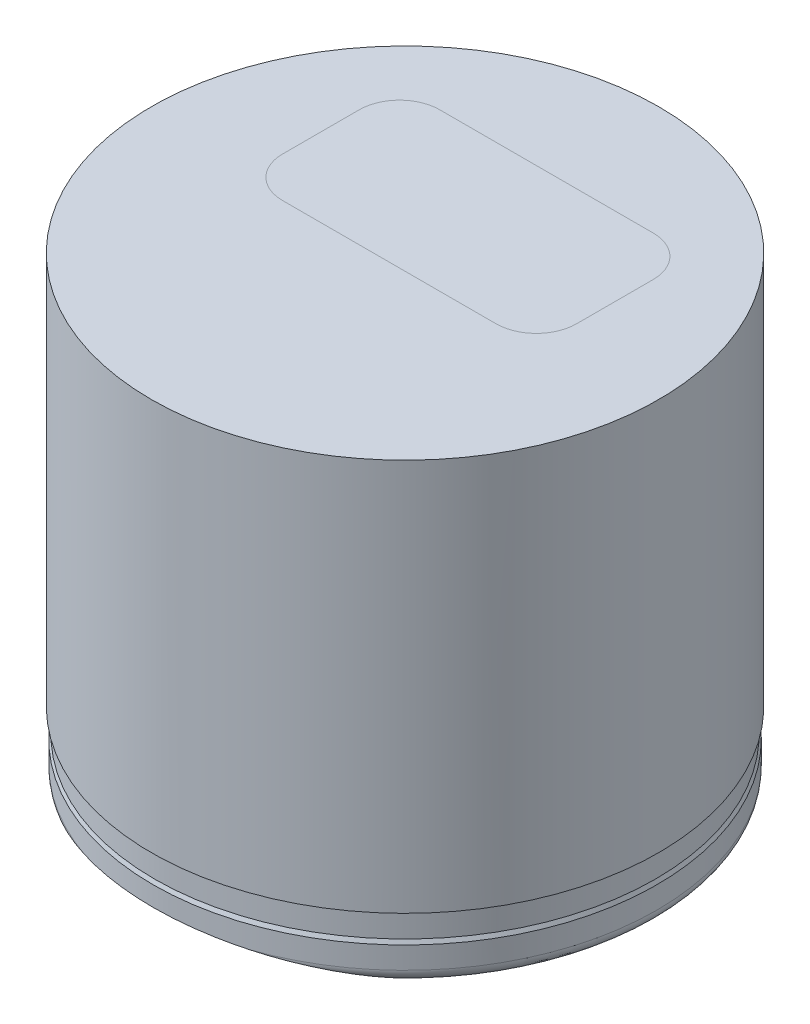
ISO-10303-21;
HEADER;
FILE_DESCRIPTION(('STEP AP214'),'2;1');
FILE_NAME('part.step','',(''),(''),'','','');
FILE_SCHEMA(('AUTOMOTIVE_DESIGN { 1 0 10303 214 1 1 1 1 }'));
ENDSEC;
DATA;
#1=APPLICATION_CONTEXT('core data for automotive mechanical design processes');
#2=APPLICATION_PROTOCOL_DEFINITION('international standard','automotive_design',2000,#1);
#3=PRODUCT_CONTEXT('',#1,'mechanical');
#4=PRODUCT('Part','Part','',(#3));
#5=PRODUCT_RELATED_PRODUCT_CATEGORY('part','',(#4));
#6=PRODUCT_DEFINITION_FORMATION('','',#4);
#7=PRODUCT_DEFINITION_CONTEXT('part definition',#1,'design');
#8=PRODUCT_DEFINITION('design','',#6,#7);
#9=PRODUCT_DEFINITION_SHAPE('','',#8);
#10=(LENGTH_UNIT() NAMED_UNIT(*) SI_UNIT(.MILLI.,.METRE.));
#11=(NAMED_UNIT(*) PLANE_ANGLE_UNIT() SI_UNIT($,.RADIAN.));
#12=(NAMED_UNIT(*) SI_UNIT($,.STERADIAN.) SOLID_ANGLE_UNIT());
#13=UNCERTAINTY_MEASURE_WITH_UNIT(LENGTH_MEASURE(1.E-05),#10,'distance_accuracy_value','');
#14=(GEOMETRIC_REPRESENTATION_CONTEXT(3) GLOBAL_UNCERTAINTY_ASSIGNED_CONTEXT((#13)) GLOBAL_UNIT_ASSIGNED_CONTEXT((#10,
#11,#12)) REPRESENTATION_CONTEXT('',''));
#15=CARTESIAN_POINT('',(0.,0.,0.));
#16=DIRECTION('',(0.,0.,1.));
#17=DIRECTION('',(1.,0.,0.));
#18=AXIS2_PLACEMENT_3D('',#15,#16,#17);
#19=CARTESIAN_POINT('',(0.,0.,0.));
#20=DIRECTION('',(0.,1.,0.));
#21=DIRECTION('',(0.,0.,1.));
#22=AXIS2_PLACEMENT_3D('',#19,#20,#21);
#23=PLANE('',#22);
#24=CARTESIAN_POINT('',(18.8489869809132,0.,5.51909035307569));
#25=DIRECTION('',(0.,1.,0.));
#26=DIRECTION('',(0.,0.,1.));
#27=AXIS2_PLACEMENT_3D('',#24,#25,#26);
#28=ELLIPSE('',#27,5.17913656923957,4.15141606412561);
#29=CARTESIAN_POINT('',(18.8489869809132,0.,10.6982269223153));
#30=VERTEX_POINT('',#29);
#31=EDGE_CURVE('E285',#30,#30,#28,.T.);
#32=ORIENTED_EDGE('',*,*,#31,.T.);
#33=EDGE_LOOP('',(#32));
#34=FACE_BOUND('',#33,.T.);
#35=CARTESIAN_POINT('',(-0.0318256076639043,0.,-4.4942267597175));
#36=DIRECTION('',(0.,-1.,0.));
#37=DIRECTION('',(0.,0.,-1.));
#38=AXIS2_PLACEMENT_3D('',#35,#36,#37);
#39=ELLIPSE('',#38,4.60448881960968,3.65956978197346);
#40=CARTESIAN_POINT('',(-0.0318256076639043,0.,-9.09871557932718));
#41=VERTEX_POINT('',#40);
#42=EDGE_CURVE('E266',#41,#41,#39,.T.);
#43=ORIENTED_EDGE('',*,*,#42,.F.);
#44=EDGE_LOOP('',(#43));
#45=FACE_BOUND('',#44,.T.);
#46=CARTESIAN_POINT('',(0.,0.,7.66782357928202));
#47=DIRECTION('',(0.,-1.,0.));
#48=DIRECTION('',(0.00632907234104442,0.,0.999979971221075));
#49=AXIS2_PLACEMENT_3D('',#46,#47,#48);
#50=ELLIPSE('',#49,5.02847904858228,3.62774417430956);
#51=CARTESIAN_POINT('',(0.0318256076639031,0.,12.6962019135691));
#52=VERTEX_POINT('',#51);
#53=EDGE_CURVE('E258',#52,#52,#50,.T.);
#54=ORIENTED_EDGE('',*,*,#53,.F.);
#55=EDGE_LOOP('',(#54));
#56=FACE_BOUND('',#55,.T.);
#57=CARTESIAN_POINT('',(-18.912638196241,0.,-3.30214239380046));
#58=DIRECTION('',(0.,-1.,0.));
#59=DIRECTION('',(0.,0.,-1.));
#60=AXIS2_PLACEMENT_3D('',#57,#58,#59);
#61=ELLIPSE('',#60,2.18486630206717,1.54812185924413);
#62=CARTESIAN_POINT('',(-18.912638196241,0.,-5.48700869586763));
#63=VERTEX_POINT('',#62);
#64=EDGE_CURVE('E239',#63,#63,#61,.T.);
#65=ORIENTED_EDGE('',*,*,#64,.F.);
#66=EDGE_LOOP('',(#65));
#67=FACE_BOUND('',#66,.T.);
#68=CARTESIAN_POINT('',(-18.912638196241,0.,5.51909035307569));
#69=DIRECTION('',(0.,-1.,0.));
#70=DIRECTION('',(0.,0.,1.));
#71=AXIS2_PLACEMENT_3D('',#68,#69,#70);
#72=ELLIPSE('',#71,5.17913656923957,4.15141606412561);
#73=CARTESIAN_POINT('',(-18.912638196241,0.,10.6982269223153));
#74=VERTEX_POINT('',#73);
#75=EDGE_CURVE('E232',#74,#74,#72,.T.);
#76=ORIENTED_EDGE('',*,*,#75,.F.);
#77=EDGE_LOOP('',(#76));
#78=FACE_BOUND('',#77,.T.);
#79=CARTESIAN_POINT('',(0.,0.,0.));
#80=DIRECTION('',(0.,1.,0.));
#81=DIRECTION('',(0.,0.,1.));
#82=AXIS2_PLACEMENT_3D('',#79,#80,#81);
#83=CIRCLE('',#82,29.718);
#84=CARTESIAN_POINT('',(-21.8623592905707,0.,20.1295));
#85=VERTEX_POINT('',#84);
#86=CARTESIAN_POINT('',(-21.8623592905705,0.,-20.1295000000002));
#87=VERTEX_POINT('',#86);
#88=EDGE_CURVE('E120',#85,#87,#83,.F.);
#89=ORIENTED_EDGE('',*,*,#88,.T.);
#90=DIRECTION('',(-1.,0.,0.));
#91=VECTOR('',#90,1.);
#92=CARTESIAN_POINT('',(31.5214000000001,0.,-20.1295));
#93=LINE('',#92,#91);
#94=CARTESIAN_POINT('',(21.862359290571,0.,-20.1295));
#95=VERTEX_POINT('',#94);
#96=EDGE_CURVE('E62',#95,#87,#93,.T.);
#97=ORIENTED_EDGE('',*,*,#96,.F.);
#98=CARTESIAN_POINT('',(21.8623592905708,0.,20.1294999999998));
#99=VERTEX_POINT('',#98);
#100=EDGE_CURVE('E69',#95,#99,#83,.F.);
#101=ORIENTED_EDGE('',*,*,#100,.T.);
#102=DIRECTION('',(-1.,0.,0.));
#103=VECTOR('',#102,1.);
#104=CARTESIAN_POINT('',(31.5214000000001,0.,20.1295));
#105=LINE('',#104,#103);
#106=EDGE_CURVE('E229',#99,#85,#105,.T.);
#107=ORIENTED_EDGE('',*,*,#106,.T.);
#108=EDGE_LOOP('',(#89,#97,#101,#107));
#109=FACE_BOUND('',#108,.T.);
#110=CARTESIAN_POINT('',(18.8489869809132,0.,-3.30214239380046));
#111=DIRECTION('',(0.,1.,0.));
#112=DIRECTION('',(0.,0.,-1.));
#113=AXIS2_PLACEMENT_3D('',#110,#111,#112);
#114=ELLIPSE('',#113,2.18486630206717,1.54812185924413);
#115=CARTESIAN_POINT('',(18.8489869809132,0.,-5.48700869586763));
#116=VERTEX_POINT('',#115);
#117=EDGE_CURVE('E293',#116,#116,#114,.T.);
#118=ORIENTED_EDGE('',*,*,#117,.T.);
#119=EDGE_LOOP('',(#118));
#120=FACE_BOUND('',#119,.T.);
#121=ADVANCED_FACE('F43',(#34,#45,#56,#67,#78,#109,#120),#23,.F.);
#122=CARTESIAN_POINT('',(0.,1.58749999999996,0.));
#123=DIRECTION('',(0.,1.,0.));
#124=DIRECTION('',(0.,0.,1.));
#125=AXIS2_PLACEMENT_3D('',#122,#123,#124);
#126=TOROIDAL_SURFACE('',#125,29.718,1.5875);
#127=CARTESIAN_POINT('',(10.2789407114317,1.58769999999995,-29.5698783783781));
#128=CARTESIAN_POINT('',(10.5281118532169,1.57313295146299,-29.4832634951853));
#129=CARTESIAN_POINT('',(10.7760853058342,1.5580069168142,-29.3933249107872));
#130=CARTESIAN_POINT('',(11.269412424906,1.52663347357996,-29.2067801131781));
#131=CARTESIAN_POINT('',(11.514766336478,1.51038617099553,-29.1101745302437));
#132=CARTESIAN_POINT('',(12.2501077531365,1.4597134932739,-28.8088775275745));
#133=CARTESIAN_POINT('',(12.7358196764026,1.42356459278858,-28.5939381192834));
#134=CARTESIAN_POINT('',(13.8462893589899,1.33443142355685,-28.0639571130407));
#135=CARTESIAN_POINT('',(14.4661219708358,1.27974992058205,-27.7388238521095));
#136=CARTESIAN_POINT('',(15.6779821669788,1.16224752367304,-27.0401609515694));
#137=CARTESIAN_POINT('',(16.2699863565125,1.09941994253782,-26.6665915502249));
#138=CARTESIAN_POINT('',(17.1304249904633,0.999148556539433,-26.0703833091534));
#139=CARTESIAN_POINT('',(17.4120863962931,0.964797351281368,-25.8661328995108));
#140=CARTESIAN_POINT('',(17.965715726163,0.894013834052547,-25.4452579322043));
#141=CARTESIAN_POINT('',(18.237685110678,0.857581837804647,-25.2286352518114));
#142=CARTESIAN_POINT('',(18.7703824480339,0.782625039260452,-24.7829461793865));
#143=CARTESIAN_POINT('',(19.031123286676,0.744102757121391,-24.5538947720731));
#144=CARTESIAN_POINT('',(19.540002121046,0.664845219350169,-24.0826337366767));
#145=CARTESIAN_POINT('',(19.7881445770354,0.624110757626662,-23.8404288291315));
#146=CARTESIAN_POINT('',(20.107215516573,0.56851415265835,-23.5098544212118));
#147=CARTESIAN_POINT('',(20.1849026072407,0.554711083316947,-23.4277821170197));
#148=CARTESIAN_POINT('',(20.3385375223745,0.526842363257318,-23.2620762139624));
#149=CARTESIAN_POINT('',(20.4144854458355,0.512776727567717,-23.1784427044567));
#150=CARTESIAN_POINT('',(20.6395395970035,0.470164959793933,-22.9250754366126));
#151=CARTESIAN_POINT('',(20.7858352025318,0.441207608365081,-22.7528965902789));
#152=CARTESIAN_POINT('',(21.0695175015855,0.382026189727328,-22.4010070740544));
#153=CARTESIAN_POINT('',(21.2068892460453,0.351800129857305,-22.2212845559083));
#154=CARTESIAN_POINT('',(21.4036021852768,0.305377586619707,-21.9452586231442));
#155=CARTESIAN_POINT('',(21.4676086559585,0.289724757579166,-21.852187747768));
#156=CARTESIAN_POINT('',(21.5917498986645,0.258006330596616,-21.6635916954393));
#157=CARTESIAN_POINT('',(21.651885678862,0.241940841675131,-21.568067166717));
#158=CARTESIAN_POINT('',(21.7671868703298,0.209308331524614,-21.3740360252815));
#159=CARTESIAN_POINT('',(21.8223501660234,0.192741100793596,-21.2755281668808));
#160=CARTESIAN_POINT('',(21.8995843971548,0.16741850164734,-21.1249613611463));
#161=CARTESIAN_POINT('',(21.9244200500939,0.158895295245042,-21.0742828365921));
#162=CARTESIAN_POINT('',(21.9716885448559,0.141668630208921,-20.9718540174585));
#163=CARTESIAN_POINT('',(21.9941223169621,0.132965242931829,-20.9201041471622));
#164=CARTESIAN_POINT('',(22.0357714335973,0.115317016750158,-20.8151687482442));
#165=CARTESIAN_POINT('',(22.054976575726,0.106371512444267,-20.7619792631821));
#166=CARTESIAN_POINT('',(22.0884546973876,0.0882418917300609,-20.654181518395));
#167=CARTESIAN_POINT('',(22.1027443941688,0.0790587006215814,-20.5995787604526));
#168=CARTESIAN_POINT('',(22.1166793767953,0.0660402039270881,-20.5221714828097));
#169=CARTESIAN_POINT('',(22.1199615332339,0.0623144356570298,-20.5000182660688));
#170=CARTESIAN_POINT('',(22.1246702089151,0.0548177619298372,-20.4554434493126));
#171=CARTESIAN_POINT('',(22.1260917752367,0.0510467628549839,-20.4330212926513));
#172=CARTESIAN_POINT('',(22.126364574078,0.0434502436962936,-20.3878528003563));
#173=CARTESIAN_POINT('',(22.1251827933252,0.0396246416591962,-20.3651059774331));
#174=CARTESIAN_POINT('',(22.1189905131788,0.0320590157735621,-20.3201211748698));
#175=CARTESIAN_POINT('',(22.1140003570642,0.0283186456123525,-20.2978811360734));
#176=CARTESIAN_POINT('',(22.1022960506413,0.0228590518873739,-20.2654186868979));
#177=CARTESIAN_POINT('',(22.0975370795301,0.0210261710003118,-20.2545204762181));
#178=CARTESIAN_POINT('',(22.0863479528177,0.017506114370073,-20.233590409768));
#179=CARTESIAN_POINT('',(22.0799200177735,0.0158187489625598,-20.2235574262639));
#180=CARTESIAN_POINT('',(22.0652915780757,0.0126465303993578,-20.2046955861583));
#181=CARTESIAN_POINT('',(22.0570774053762,0.0111633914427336,-20.1958769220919));
#182=CARTESIAN_POINT('',(22.0391179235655,0.00847826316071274,-20.1799112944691));
#183=CARTESIAN_POINT('',(22.029372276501,0.00727633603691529,-20.17276470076));
#184=CARTESIAN_POINT('',(22.009651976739,0.00526743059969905,-20.1608198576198));
#185=CARTESIAN_POINT('',(21.9997683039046,0.00443545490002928,-20.1558729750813));
#186=CARTESIAN_POINT('',(21.979396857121,0.00301260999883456,-20.1474128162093));
#187=CARTESIAN_POINT('',(21.9689088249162,0.00242184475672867,-20.143900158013));
#188=CARTESIAN_POINT('',(21.939644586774,0.00109067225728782,-20.1359850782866));
#189=CARTESIAN_POINT('',(21.9205149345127,0.000566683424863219,-20.1328694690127));
#190=CARTESIAN_POINT('',(21.8819983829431,-9.17007251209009E-06,-20.1294454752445));
#191=CARTESIAN_POINT('',(21.8626107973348,-5.92955597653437E-05,-20.1291474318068));
#192=CARTESIAN_POINT('',(21.8175176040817,0.000218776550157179,-20.1308008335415));
#193=CARTESIAN_POINT('',(21.7918469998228,0.000677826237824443,-20.1335303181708));
#194=CARTESIAN_POINT('',(21.7408684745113,0.00199725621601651,-20.1413755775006));
#195=CARTESIAN_POINT('',(21.7155614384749,0.00285848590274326,-20.146496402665));
#196=CARTESIAN_POINT('',(21.6400134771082,0.00586881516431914,-20.1643956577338));
#197=CARTESIAN_POINT('',(21.5903978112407,0.00844024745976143,-20.1796852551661));
#198=CARTESIAN_POINT('',(21.4889477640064,0.0144155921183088,-20.2152143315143));
#199=CARTESIAN_POINT('',(21.4372222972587,0.017867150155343,-20.2357371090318));
#200=CARTESIAN_POINT('',(21.3349409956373,0.025223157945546,-20.2794755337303));
#201=CARTESIAN_POINT('',(21.2843856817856,0.0291278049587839,-20.302692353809));
#202=CARTESIAN_POINT('',(21.1337949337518,0.0413106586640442,-20.3751309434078));
#203=CARTESIAN_POINT('',(21.0351024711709,0.0500399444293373,-20.427034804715));
#204=CARTESIAN_POINT('',(20.8397508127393,0.0681369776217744,-20.5346387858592));
#205=CARTESIAN_POINT('',(20.7430946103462,0.0775055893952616,-20.5903440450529));
#206=CARTESIAN_POINT('',(20.5513199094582,0.0966096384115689,-20.7039356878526));
#207=CARTESIAN_POINT('',(20.4561992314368,0.106344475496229,-20.7618185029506));
#208=CARTESIAN_POINT('',(20.2680077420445,0.125928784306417,-20.8782657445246));
#209=CARTESIAN_POINT('',(20.1749260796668,0.135775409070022,-20.9368132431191));
#210=CARTESIAN_POINT('',(19.989323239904,0.155613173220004,-21.0547675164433));
#211=CARTESIAN_POINT('',(19.8968020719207,0.165604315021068,-21.1141743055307));
#212=CARTESIAN_POINT('',(19.6197182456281,0.195704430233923,-21.2931479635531));
#213=CARTESIAN_POINT('',(19.4356510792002,0.215938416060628,-21.4134581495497));
#214=CARTESIAN_POINT('',(19.0675462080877,0.256461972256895,-21.6544090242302));
#215=CARTESIAN_POINT('',(18.8835086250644,0.276751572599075,-21.7750498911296));
#216=CARTESIAN_POINT('',(18.5149319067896,0.317202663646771,-22.0155698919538));
#217=CARTESIAN_POINT('',(18.3303927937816,0.337364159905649,-22.1354490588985));
#218=CARTESIAN_POINT('',(17.9608869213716,0.377387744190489,-22.3734271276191));
#219=CARTESIAN_POINT('',(17.7759228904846,0.397250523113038,-22.4915301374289));
#220=CARTESIAN_POINT('',(17.4047515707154,0.436654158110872,-22.7258220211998));
#221=CARTESIAN_POINT('',(17.2185442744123,0.456195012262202,-22.8420108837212));
#222=CARTESIAN_POINT('',(16.6577707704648,0.514233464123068,-23.1871043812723));
#223=CARTESIAN_POINT('',(16.2810070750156,0.552151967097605,-23.4125657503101));
#224=CARTESIAN_POINT('',(15.6150284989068,0.616900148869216,-23.7975549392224));
#225=CARTESIAN_POINT('',(15.3272874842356,0.644146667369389,-23.9595612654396));
#226=CARTESIAN_POINT('',(14.7477994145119,0.697441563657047,-24.2764498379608));
#227=CARTESIAN_POINT('',(14.4560523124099,0.723489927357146,-24.431332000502));
#228=CARTESIAN_POINT('',(13.5746546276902,0.799686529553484,-24.8843928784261));
#229=CARTESIAN_POINT('',(12.9788140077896,0.847889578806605,-25.1710056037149));
#230=CARTESIAN_POINT('',(11.7700887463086,0.938531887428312,-25.7099598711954));
#231=CARTESIAN_POINT('',(11.1571756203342,0.980960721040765,-25.9622394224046));
#232=CARTESIAN_POINT('',(9.91656821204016,1.05944421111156,-26.4288980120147));
#233=CARTESIAN_POINT('',(9.28887191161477,1.09549799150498,-26.643271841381));
#234=CARTESIAN_POINT('',(7.86860402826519,1.16862048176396,-27.0780542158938));
#235=CARTESIAN_POINT('',(7.07257265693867,1.20386145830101,-27.2875951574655));
#236=CARTESIAN_POINT('',(5.46546329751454,1.26321694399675,-27.6405196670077));
#237=CARTESIAN_POINT('',(4.65438388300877,1.28733039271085,-27.7838969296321));
#238=CARTESIAN_POINT('',(3.02292885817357,1.32396769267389,-28.0017403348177));
#239=CARTESIAN_POINT('',(2.20255563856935,1.33649445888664,-28.0762238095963));
#240=CARTESIAN_POINT('',(0.558381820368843,1.34972384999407,-28.1548850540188));
#241=CARTESIAN_POINT('',(-0.265418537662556,1.35042729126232,-28.1590676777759));
#242=CARTESIAN_POINT('',(-1.86111177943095,1.34031232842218,-28.0989246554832));
#243=CARTESIAN_POINT('',(-2.63316633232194,1.33017954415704,-28.0386756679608));
#244=CARTESIAN_POINT('',(-4.16982305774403,1.29962732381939,-27.8570138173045));
#245=CARTESIAN_POINT('',(-4.93442528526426,1.27920796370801,-27.7356014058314));
#246=CARTESIAN_POINT('',(-6.45123394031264,1.22843533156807,-27.4337100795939));
#247=CARTESIAN_POINT('',(-7.20344421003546,1.19808520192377,-27.2532498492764));
#248=CARTESIAN_POINT('',(-8.69158884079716,1.12794699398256,-26.8362118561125));
#249=CARTESIAN_POINT('',(-9.42752493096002,1.08815992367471,-26.5996400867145));
#250=CARTESIAN_POINT('',(-10.6774100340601,1.01211581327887,-26.1474859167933));
#251=CARTESIAN_POINT('',(-11.1960736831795,0.977964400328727,-25.9444234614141));
#252=CARTESIAN_POINT('',(-12.2223245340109,0.905386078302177,-25.5128766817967));
#253=CARTESIAN_POINT('',(-12.7299132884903,0.866959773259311,-25.2843959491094));
#254=CARTESIAN_POINT('',(-13.7332004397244,0.786201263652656,-24.8042102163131));
#255=CARTESIAN_POINT('',(-14.2289066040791,0.743871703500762,-24.5525209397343));
#256=CARTESIAN_POINT('',(-15.2088043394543,0.655701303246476,-24.0282645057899));
#257=CARTESIAN_POINT('',(-15.6929958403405,0.609860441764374,-23.7556972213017));
#258=CARTESIAN_POINT('',(-16.4431447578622,0.535746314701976,-23.3150186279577));
#259=CARTESIAN_POINT('',(-16.712721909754,0.508471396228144,-23.1528434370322));
#260=CARTESIAN_POINT('',(-17.2488476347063,0.453120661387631,-22.8237309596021));
#261=CARTESIAN_POINT('',(-17.5153963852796,0.425044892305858,-22.6567939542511));
#262=CARTESIAN_POINT('',(-18.046104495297,0.36827665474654,-22.3192530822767));
#263=CARTESIAN_POINT('',(-18.3102637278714,0.339584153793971,-22.1486490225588));
#264=CARTESIAN_POINT('',(-18.7055269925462,0.29630305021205,-21.8913019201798));
#265=CARTESIAN_POINT('',(-18.8371168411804,0.281835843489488,-21.8052806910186));
#266=CARTESIAN_POINT('',(-19.1001941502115,0.252875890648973,-21.6330863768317));
#267=CARTESIAN_POINT('',(-19.2316816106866,0.238383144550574,-21.5469132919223));
#268=CARTESIAN_POINT('',(-19.4947968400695,0.209450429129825,-21.3748809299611));
#269=CARTESIAN_POINT('',(-19.6264245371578,0.195010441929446,-21.2890215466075));
#270=CARTESIAN_POINT('',(-19.8903232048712,0.166284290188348,-21.1182174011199));
#271=CARTESIAN_POINT('',(-20.0225942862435,0.151998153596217,-21.0332728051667));
#272=CARTESIAN_POINT('',(-20.2884661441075,0.123744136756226,-20.8652759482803));
#273=CARTESIAN_POINT('',(-20.4220674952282,0.109776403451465,-20.7822245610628));
#274=CARTESIAN_POINT('',(-20.6242418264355,0.0893119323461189,-20.660543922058));
#275=CARTESIAN_POINT('',(-20.691918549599,0.0825725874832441,-20.6204721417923));
#276=CARTESIAN_POINT('',(-20.8280955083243,0.0693275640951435,-20.5417179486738));
#277=CARTESIAN_POINT('',(-20.8965956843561,0.0628218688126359,-20.5030354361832));
#278=CARTESIAN_POINT('',(-21.0483861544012,0.0488973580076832,-20.4202410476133));
#279=CARTESIAN_POINT('',(-21.1319244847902,0.0415521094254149,-20.3765665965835));
#280=CARTESIAN_POINT('',(-21.3012705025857,0.0276885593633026,-20.2941346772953));
#281=CARTESIAN_POINT('',(-21.3870719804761,0.0211682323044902,-20.2553651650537));
#282=CARTESIAN_POINT('',(-21.5336121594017,0.0116313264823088,-20.1986592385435));
#283=CARTESIAN_POINT('',(-21.5932287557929,0.0081698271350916,-20.178077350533));
#284=CARTESIAN_POINT('',(-21.6879460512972,0.0038766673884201,-20.152550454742));
#285=CARTESIAN_POINT('',(-21.7222283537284,0.00255898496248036,-20.1447155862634));
#286=CARTESIAN_POINT('',(-21.7915015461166,0.000626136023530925,-20.1332229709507));
#287=CARTESIAN_POINT('',(-21.826488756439,7.97386302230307E-06,-20.1295474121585));
#288=CARTESIAN_POINT('',(-21.8762992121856,-3.19217270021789E-06,-20.1294810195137));
#289=CARTESIAN_POINT('',(-21.8910992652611,0.000102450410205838,-20.1301091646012));
#290=CARTESIAN_POINT('',(-21.9205546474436,0.000600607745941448,-20.1330711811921));
#291=CARTESIAN_POINT('',(-21.9352098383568,0.000993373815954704,-20.1354065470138));
#292=CARTESIAN_POINT('',(-21.9642393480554,0.00215258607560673,-20.1422991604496));
#293=CARTESIAN_POINT('',(-21.9786060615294,0.00292459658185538,-20.1468894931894));
#294=CARTESIAN_POINT('',(-22.0061396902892,0.00492034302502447,-20.1587560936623));
#295=CARTESIAN_POINT('',(-22.019310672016,0.00614247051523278,-20.1660227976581));
#296=CARTESIAN_POINT('',(-22.0421701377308,0.00887509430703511,-20.1822708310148));
#297=CARTESIAN_POINT('',(-22.0520872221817,0.0103326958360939,-20.1909376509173));
#298=CARTESIAN_POINT('',(-22.0699427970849,0.0135509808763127,-20.2100733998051));
#299=CARTESIAN_POINT('',(-22.0778793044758,0.0153119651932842,-20.2205441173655));
#300=CARTESIAN_POINT('',(-22.0921765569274,0.0191780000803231,-20.2435313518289));
#301=CARTESIAN_POINT('',(-22.0983795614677,0.0212987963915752,-20.256141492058));
#302=CARTESIAN_POINT('',(-22.1086584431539,0.0256765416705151,-20.2821713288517));
#303=CARTESIAN_POINT('',(-22.1127305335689,0.0279337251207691,-20.295592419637));
#304=CARTESIAN_POINT('',(-22.1213255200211,0.0340778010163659,-20.3321247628));
#305=CARTESIAN_POINT('',(-22.1242541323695,0.0380240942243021,-20.3555892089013));
#306=CARTESIAN_POINT('',(-22.1267642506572,0.0459431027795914,-20.4026752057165));
#307=CARTESIAN_POINT('',(-22.126335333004,0.0499158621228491,-20.4262970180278));
#308=CARTESIAN_POINT('',(-22.1224053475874,0.0596848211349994,-20.4843827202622));
#309=CARTESIAN_POINT('',(-22.1175611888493,0.0654647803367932,-20.5187500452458));
#310=CARTESIAN_POINT('',(-22.1046778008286,0.0769294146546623,-20.5869181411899));
#311=CARTESIAN_POINT('',(-22.0966313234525,0.0826138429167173,-20.6207174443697));
#312=CARTESIAN_POINT('',(-22.0782456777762,0.0939116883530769,-20.6878938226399));
#313=CARTESIAN_POINT('',(-22.0678941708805,0.099524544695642,-20.7212675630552));
#314=CARTESIAN_POINT('',(-22.0455169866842,0.110649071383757,-20.7874133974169));
#315=CARTESIAN_POINT('',(-22.0334931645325,0.116160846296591,-20.8201861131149));
#316=CARTESIAN_POINT('',(-21.9968581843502,0.131970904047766,-20.9141918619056));
#317=CARTESIAN_POINT('',(-21.9705704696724,0.142162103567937,-20.9747881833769));
#318=CARTESIAN_POINT('',(-21.9147883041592,0.162301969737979,-21.0945387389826));
#319=CARTESIAN_POINT('',(-21.885291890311,0.172250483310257,-21.1536920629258));
#320=CARTESIAN_POINT('',(-21.7930959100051,0.201827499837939,-21.3295554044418));
#321=CARTESIAN_POINT('',(-21.726792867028,0.221146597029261,-21.4444257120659));
#322=CARTESIAN_POINT('',(-21.5878587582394,0.259157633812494,-21.6704372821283));
#323=CARTESIAN_POINT('',(-21.5152221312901,0.277849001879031,-21.7815751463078));
#324=CARTESIAN_POINT('',(-21.3652541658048,0.314670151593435,-22.0005117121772));
#325=CARTESIAN_POINT('',(-21.287928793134,0.332800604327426,-22.108314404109));
#326=CARTESIAN_POINT('',(-21.0759721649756,0.380667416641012,-22.3929278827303));
#327=CARTESIAN_POINT('',(-20.9378752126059,0.40998134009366,-22.5672268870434));
#328=CARTESIAN_POINT('',(-20.6533498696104,0.467482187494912,-22.9091238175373));
#329=CARTESIAN_POINT('',(-20.5069185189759,0.495668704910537,-23.0767193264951));
#330=CARTESIAN_POINT('',(-20.2068976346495,0.551050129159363,-23.4060142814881));
#331=CARTESIAN_POINT('',(-20.0532974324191,0.578243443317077,-23.567704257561));
#332=CARTESIAN_POINT('',(-19.7400602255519,0.631658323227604,-23.8853062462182));
#333=CARTESIAN_POINT('',(-19.5804224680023,0.657879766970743,-24.0412175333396));
#334=CARTESIAN_POINT('',(-19.0926554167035,0.735282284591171,-24.5014487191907));
#335=CARTESIAN_POINT('',(-18.7564147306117,0.785066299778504,-24.7974617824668));
#336=CARTESIAN_POINT('',(-18.06643535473,0.881055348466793,-25.3682074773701));
#337=CARTESIAN_POINT('',(-17.7127098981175,0.927263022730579,-25.6429558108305));
#338=CARTESIAN_POINT('',(-16.8111501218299,1.03827059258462,-26.3030008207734));
#339=CARTESIAN_POINT('',(-16.2538347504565,1.10096356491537,-26.6757698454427));
#340=CARTESIAN_POINT('',(-15.1108303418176,1.21892239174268,-27.3771466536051));
#341=CARTESIAN_POINT('',(-14.5251165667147,1.27418160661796,-27.7057149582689));
#342=CARTESIAN_POINT('',(-13.3390757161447,1.37657493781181,-28.3145401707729));
#343=CARTESIAN_POINT('',(-12.7390757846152,1.42381360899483,-28.5954187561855));
#344=CARTESIAN_POINT('',(-11.5214538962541,1.5111006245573,-29.1144226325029));
#345=CARTESIAN_POINT('',(-10.9038612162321,1.55116018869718,-29.3526146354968));
#346=CARTESIAN_POINT('',(-10.2789407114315,1.58769999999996,-29.5698783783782));
#347=B_SPLINE_CURVE_WITH_KNOTS('',3,(#127,#128,#129,#130,#131,#132,#133,#134,#135,#136,#137,
#138,#139,#140,#141,#142,#143,#144,#145,#146,#147,#148,#149,#150,#151,#152,#153,#154,#155,#156,
#157,#158,#159,#160,#161,#162,#163,#164,#165,#166,#167,#168,#169,#170,#171,#172,#173,#174,#175,
#176,#177,#178,#179,#180,#181,#182,#183,#184,#185,#186,#187,#188,#189,#190,#191,#192,#193,#194,
#195,#196,#197,#198,#199,#200,#201,#202,#203,#204,#205,#206,#207,#208,#209,#210,#211,#212,#213,
#214,#215,#216,#217,#218,#219,#220,#221,#222,#223,#224,#225,#226,#227,#228,#229,#230,#231,#232,
#233,#234,#235,#236,#237,#238,#239,#240,#241,#242,#243,#244,#245,#246,#247,#248,#249,#250,#251,
#252,#253,#254,#255,#256,#257,#258,#259,#260,#261,#262,#263,#264,#265,#266,#267,#268,#269,#270,
#271,#272,#273,#274,#275,#276,#277,#278,#279,#280,#281,#282,#283,#284,#285,#286,#287,#288,#289,
#290,#291,#292,#293,#294,#295,#296,#297,#298,#299,#300,#301,#302,#303,#304,#305,#306,#307,#308,
#309,#310,#311,#312,#313,#314,#315,#316,#317,#318,#319,#320,#321,#322,#323,#324,#325,#326,#327,
#328,#329,#330,#331,#332,#333,#334,#335,#336,#337,#338,#339,#340,#341,#342,#343,#344,#345,#346),
.UNSPECIFIED.,.F.,.F.,(4,2,2,2,2,2,2,2,2,2,2,2,2,2,2,2,2,2,2,2,2,2,2,2,2,2,2,2,2,2,2,2,2,2,2,2,
2,2,2,2,2,2,2,2,2,2,2,2,2,2,2,2,2,2,2,2,2,2,2,2,2,2,2,2,2,2,2,2,2,2,2,2,2,2,2,2,2,2,2,2,2,2,2,2,
2,2,2,2,2,2,2,2,2,2,2,2,2,2,2,2,2,2,2,2,2,2,2,2,2,4),(0.,0.792550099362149,1.58502537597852,
3.18126520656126,5.28534028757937,7.39115369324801,8.43971171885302,9.48811106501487,
10.5352733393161,11.5820622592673,11.9235921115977,12.2651024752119,12.9482142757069,
13.6324423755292,13.9744750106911,14.3164181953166,14.6585061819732,14.8296954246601,
15.0008181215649,15.1724717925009,15.3435357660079,15.411591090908,15.4798272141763,
15.5489336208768,15.6176734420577,15.6536516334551,15.6895821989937,15.72579803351,
15.7620218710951,15.7951455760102,15.8282835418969,15.8861098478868,15.9441483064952,
16.0214165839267,16.0988487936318,16.2544661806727,16.4216417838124,16.5888904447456,
16.9242508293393,17.2600739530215,17.5953688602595,17.9265736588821,18.2577839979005,
18.9202609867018,19.5832261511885,20.2461623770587,20.9072043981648,21.5682503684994,
22.8901775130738,23.8840871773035,24.8780085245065,26.8657340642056,28.8570022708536,
30.8485439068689,33.3173971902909,35.7864857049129,38.2549528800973,40.7232496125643,
43.0441301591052,45.3649935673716,47.685123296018,50.0050053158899,51.678455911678,
53.3516703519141,55.0237594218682,56.6958586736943,57.6431494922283,58.5903844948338,
59.5376694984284,60.0112977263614,60.4849255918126,60.9583744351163,61.4319078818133,
61.9056556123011,62.1424596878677,62.3792467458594,62.6628200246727,62.9456828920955,
63.1347634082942,63.2402201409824,63.3452235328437,63.389590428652,63.4339962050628,
63.479073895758,63.5239920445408,63.563466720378,63.6029807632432,63.645385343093,
63.6878650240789,63.7593799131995,63.8311169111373,63.9364071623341,64.0419370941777,
64.1480461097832,64.2540383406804,64.4543889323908,64.654862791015,65.0566095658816,
65.4587127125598,65.8603145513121,66.5328645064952,67.205654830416,67.8794804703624,
68.5533904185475,69.9045111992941,71.254624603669,73.2724488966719,75.2920636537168,
77.2829009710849,79.2705992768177),.UNSPECIFIED.);
#348=CARTESIAN_POINT('',(10.2823611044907,1.58749999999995,-29.5686891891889));
#349=VERTEX_POINT('',#348);
#350=EDGE_CURVE('E12',#349,#95,#347,.T.);
#351=ORIENTED_EDGE('',*,*,#350,.F.);
#352=CARTESIAN_POINT('',(0.,1.58749999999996,0.));
#353=DIRECTION('',(0.,1.,0.));
#354=DIRECTION('',(0.,0.,1.));
#355=AXIS2_PLACEMENT_3D('',#352,#353,#354);
#356=CIRCLE('',#355,31.3055);
#357=CARTESIAN_POINT('',(10.2823611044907,1.58749999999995,29.5686891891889));
#358=VERTEX_POINT('',#357);
#359=EDGE_CURVE('E127',#358,#349,#356,.T.);
#360=ORIENTED_EDGE('',*,*,#359,.F.);
#361=CARTESIAN_POINT('',(-10.2789407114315,1.58769999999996,29.5698783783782));
#362=CARTESIAN_POINT('',(-10.5281118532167,1.573132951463,29.4832634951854));
#363=CARTESIAN_POINT('',(-10.7760853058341,1.55800691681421,29.3933249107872));
#364=CARTESIAN_POINT('',(-11.2694124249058,1.52663347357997,29.2067801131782));
#365=CARTESIAN_POINT('',(-11.5147663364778,1.51038617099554,29.1101745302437));
#366=CARTESIAN_POINT('',(-12.2501077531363,1.45971349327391,28.8088775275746));
#367=CARTESIAN_POINT('',(-12.7358196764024,1.42356459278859,28.5939381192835));
#368=CARTESIAN_POINT('',(-13.8462893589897,1.33443142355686,28.0639571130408));
#369=CARTESIAN_POINT('',(-14.4661219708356,1.27974992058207,27.7388238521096));
#370=CARTESIAN_POINT('',(-15.6779821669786,1.16224752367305,27.0401609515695));
#371=CARTESIAN_POINT('',(-16.2699863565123,1.09941994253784,26.666591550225));
#372=CARTESIAN_POINT('',(-17.1304249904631,0.999148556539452,26.0703833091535));
#373=CARTESIAN_POINT('',(-17.4120863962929,0.964797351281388,25.866132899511));
#374=CARTESIAN_POINT('',(-17.9657157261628,0.894013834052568,25.4452579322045));
#375=CARTESIAN_POINT('',(-18.2376851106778,0.857581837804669,25.2286352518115));
#376=CARTESIAN_POINT('',(-18.7703824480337,0.782625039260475,24.7829461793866));
#377=CARTESIAN_POINT('',(-19.0311232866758,0.744102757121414,24.5538947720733));
#378=CARTESIAN_POINT('',(-19.5400021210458,0.664845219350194,24.0826337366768));
#379=CARTESIAN_POINT('',(-19.7881445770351,0.624110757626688,23.8404288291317));
#380=CARTESIAN_POINT('',(-20.1072155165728,0.568514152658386,23.509854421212));
#381=CARTESIAN_POINT('',(-20.1849026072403,0.554711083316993,23.42778211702));
#382=CARTESIAN_POINT('',(-20.3385375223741,0.526842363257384,23.2620762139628));
#383=CARTESIAN_POINT('',(-20.414485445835,0.512776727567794,23.1784427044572));
#384=CARTESIAN_POINT('',(-20.6395395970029,0.470164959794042,22.9250754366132));
#385=CARTESIAN_POINT('',(-20.7858352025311,0.441207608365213,22.7528965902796));
#386=CARTESIAN_POINT('',(-21.0695175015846,0.382026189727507,22.4010070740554));
#387=CARTESIAN_POINT('',(-21.2068892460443,0.351800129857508,22.2212845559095));
#388=CARTESIAN_POINT('',(-21.4036021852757,0.30537758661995,21.9452586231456));
#389=CARTESIAN_POINT('',(-21.4676086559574,0.289724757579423,21.8521877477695));
#390=CARTESIAN_POINT('',(-21.5917498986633,0.2580063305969,21.663591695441));
#391=CARTESIAN_POINT('',(-21.6518856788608,0.241940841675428,21.5680671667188));
#392=CARTESIAN_POINT('',(-21.7671868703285,0.20930833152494,21.3740360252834));
#393=CARTESIAN_POINT('',(-21.8223501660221,0.192741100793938,21.2755281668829));
#394=CARTESIAN_POINT('',(-21.8995843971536,0.167418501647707,21.1249613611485));
#395=CARTESIAN_POINT('',(-21.9244200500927,0.158895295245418,21.0742828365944));
#396=CARTESIAN_POINT('',(-21.9716885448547,0.141668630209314,20.9718540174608));
#397=CARTESIAN_POINT('',(-21.9941223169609,0.132965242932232,20.9201041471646));
#398=CARTESIAN_POINT('',(-22.0357714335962,0.11531701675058,20.8151687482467));
#399=CARTESIAN_POINT('',(-22.0549765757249,0.1063715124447,20.7619792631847));
#400=CARTESIAN_POINT('',(-22.0884546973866,0.0882418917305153,20.6541815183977));
#401=CARTESIAN_POINT('',(-22.1027443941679,0.0790587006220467,20.5995787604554));
#402=CARTESIAN_POINT('',(-22.1166793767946,0.0660402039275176,20.5221714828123));
#403=CARTESIAN_POINT('',(-22.1199615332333,0.0623144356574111,20.5000182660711));
#404=CARTESIAN_POINT('',(-22.1246702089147,0.0548177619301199,20.4554434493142));
#405=CARTESIAN_POINT('',(-22.1260917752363,0.0510467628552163,20.4330212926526));
#406=CARTESIAN_POINT('',(-22.1263645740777,0.0434502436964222,20.3878528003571));
#407=CARTESIAN_POINT('',(-22.1251827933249,0.0396246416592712,20.3651059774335));
#408=CARTESIAN_POINT('',(-22.1189905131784,0.032059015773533,20.3201211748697));
#409=CARTESIAN_POINT('',(-22.1140003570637,0.028318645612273,20.297881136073));
#410=CARTESIAN_POINT('',(-22.1022960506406,0.0228590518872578,20.2654186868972));
#411=CARTESIAN_POINT('',(-22.0975370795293,0.0210261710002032,20.2545204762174));
#412=CARTESIAN_POINT('',(-22.0863479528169,0.017506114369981,20.2335904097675));
#413=CARTESIAN_POINT('',(-22.0799200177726,0.0158187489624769,20.2235574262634));
#414=CARTESIAN_POINT('',(-22.0652915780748,0.0126465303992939,20.204695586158));
#415=CARTESIAN_POINT('',(-22.0570774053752,0.0111633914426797,20.1958769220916));
#416=CARTESIAN_POINT('',(-22.0391179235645,0.0084782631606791,20.1799112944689));
#417=CARTESIAN_POINT('',(-22.0293722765,0.00727633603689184,20.1727647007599));
#418=CARTESIAN_POINT('',(-22.009651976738,0.00526743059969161,20.1608198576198));
#419=CARTESIAN_POINT('',(-21.9997683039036,0.0044354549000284,20.1558729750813));
#420=CARTESIAN_POINT('',(-21.9793968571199,0.00301260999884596,20.1474128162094));
#421=CARTESIAN_POINT('',(-21.9689088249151,0.0024218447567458,20.1439001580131));
#422=CARTESIAN_POINT('',(-21.9396445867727,0.00109067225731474,20.1359850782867));
#423=CARTESIAN_POINT('',(-21.9205149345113,0.000566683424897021,20.1328694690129));
#424=CARTESIAN_POINT('',(-21.8819983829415,-9.17007246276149E-06,20.1294454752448));
#425=CARTESIAN_POINT('',(-21.8626107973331,-5.92955597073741E-05,20.1291474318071));
#426=CARTESIAN_POINT('',(-21.8175176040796,0.000218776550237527,20.130800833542));
#427=CARTESIAN_POINT('',(-21.7918469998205,0.000677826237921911,20.1335303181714));
#428=CARTESIAN_POINT('',(-21.7408684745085,0.0019972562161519,20.1413755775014));
#429=CARTESIAN_POINT('',(-21.7155614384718,0.00285848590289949,20.1464964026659));
#430=CARTESIAN_POINT('',(-21.6400134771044,0.00586881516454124,20.1643956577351));
#431=CARTESIAN_POINT('',(-21.5903978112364,0.00844024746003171,20.1796852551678));
#432=CARTESIAN_POINT('',(-21.4889477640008,0.0144155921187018,20.2152143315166));
#433=CARTESIAN_POINT('',(-21.4372222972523,0.0178671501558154,20.2357371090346));
#434=CARTESIAN_POINT('',(-21.3349409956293,0.0252231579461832,20.2794755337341));
#435=CARTESIAN_POINT('',(-21.2843856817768,0.0291278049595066,20.3026923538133));
#436=CARTESIAN_POINT('',(-21.1337949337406,0.0413106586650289,20.3751309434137));
#437=CARTESIAN_POINT('',(-21.0351024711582,0.0500399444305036,20.4270348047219));
#438=CARTESIAN_POINT('',(-20.8397508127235,0.0681369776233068,20.5346387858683));
#439=CARTESIAN_POINT('',(-20.7430946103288,0.0775055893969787,20.5903440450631));
#440=CARTESIAN_POINT('',(-20.5513199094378,0.0966096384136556,20.703935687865));
#441=CARTESIAN_POINT('',(-20.4561992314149,0.106344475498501,20.7618185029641));
#442=CARTESIAN_POINT('',(-20.2680077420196,0.125928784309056,20.8782657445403));
#443=CARTESIAN_POINT('',(-20.1749260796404,0.135775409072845,20.9368132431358));
#444=CARTESIAN_POINT('',(-19.9893232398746,0.155613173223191,21.0547675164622));
#445=CARTESIAN_POINT('',(-19.8968020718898,0.165604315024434,21.1141743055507));
#446=CARTESIAN_POINT('',(-19.6197182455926,0.195704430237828,21.2931479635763));
#447=CARTESIAN_POINT('',(-19.4356510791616,0.215938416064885,21.413458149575));
#448=CARTESIAN_POINT('',(-19.067546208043,0.256461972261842,21.6544090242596));
#449=CARTESIAN_POINT('',(-18.8835086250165,0.27675157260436,21.7750498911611));
#450=CARTESIAN_POINT('',(-18.5149319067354,0.317202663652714,22.0155698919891));
#451=CARTESIAN_POINT('',(-18.3303927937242,0.337364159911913,22.1354490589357));
#452=CARTESIAN_POINT('',(-17.9608869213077,0.377387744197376,22.3734271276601));
#453=CARTESIAN_POINT('',(-17.7759228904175,0.397250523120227,22.4915301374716));
#454=CARTESIAN_POINT('',(-17.4047515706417,0.436654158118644,22.725822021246));
#455=CARTESIAN_POINT('',(-17.2185442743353,0.456195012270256,22.8420108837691));
#456=CARTESIAN_POINT('',(-16.6577707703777,0.514233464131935,23.187104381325));
#457=CARTESIAN_POINT('',(-16.2810070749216,0.552151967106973,23.4125657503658));
#458=CARTESIAN_POINT('',(-15.6150284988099,0.616900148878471,23.7975549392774));
#459=CARTESIAN_POINT('',(-15.3272874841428,0.644146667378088,23.9595612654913));
#460=CARTESIAN_POINT('',(-14.7477994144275,0.697441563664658,24.2764498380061));
#461=CARTESIAN_POINT('',(-14.4560523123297,0.723489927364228,24.4313320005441));
#462=CARTESIAN_POINT('',(-13.5746546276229,0.799686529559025,24.8843928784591));
#463=CARTESIAN_POINT('',(-12.9788140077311,0.847889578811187,25.1710056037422));
#464=CARTESIAN_POINT('',(-11.7700887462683,0.938531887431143,25.7099598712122));
#465=CARTESIAN_POINT('',(-11.1571756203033,0.980960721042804,25.9622394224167));
#466=CARTESIAN_POINT('',(-9.91656821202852,1.05944421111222,26.4288980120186));
#467=CARTESIAN_POINT('',(-9.288871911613,1.09549799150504,26.6432718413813));
#468=CARTESIAN_POINT('',(-7.86860402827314,1.16862048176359,27.0780542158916));
#469=CARTESIAN_POINT('',(-7.07257265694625,1.2038614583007,27.2875951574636));
#470=CARTESIAN_POINT('',(-5.46546329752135,1.26321694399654,27.6405196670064));
#471=CARTESIAN_POINT('',(-4.65438388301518,1.28733039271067,27.783896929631));
#472=CARTESIAN_POINT('',(-3.02292885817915,1.3239676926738,28.0017403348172));
#473=CARTESIAN_POINT('',(-2.2025556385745,1.33649445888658,28.0762238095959));
#474=CARTESIAN_POINT('',(-0.558381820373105,1.34972384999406,28.1548850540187));
#475=CARTESIAN_POINT('',(0.265418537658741,1.35042729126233,28.159067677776));
#476=CARTESIAN_POINT('',(1.86111177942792,1.34031232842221,28.0989246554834));
#477=CARTESIAN_POINT('',(2.63316633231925,1.33017954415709,28.0386756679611));
#478=CARTESIAN_POINT('',(4.169823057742,1.29962732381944,27.8570138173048));
#479=CARTESIAN_POINT('',(4.93442528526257,1.27920796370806,27.7356014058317));
#480=CARTESIAN_POINT('',(6.45123394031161,1.22843533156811,27.4337100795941));
#481=CARTESIAN_POINT('',(7.20344421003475,1.1980852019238,27.2532498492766));
#482=CARTESIAN_POINT('',(8.69158884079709,1.12794699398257,26.8362118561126));
#483=CARTESIAN_POINT('',(9.42752493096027,1.08815992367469,26.5996400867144));
#484=CARTESIAN_POINT('',(10.6774100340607,1.01211581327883,26.147485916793));
#485=CARTESIAN_POINT('',(11.1960736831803,0.97796440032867,25.9444234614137));
#486=CARTESIAN_POINT('',(12.222324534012,0.905386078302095,25.5128766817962));
#487=CARTESIAN_POINT('',(12.7299132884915,0.866959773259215,25.2843959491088));
#488=CARTESIAN_POINT('',(13.7332004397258,0.78620126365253,24.8042102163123));
#489=CARTESIAN_POINT('',(14.2289066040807,0.743871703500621,24.5525209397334));
#490=CARTESIAN_POINT('',(15.2088043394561,0.655701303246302,24.0282645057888));
#491=CARTESIAN_POINT('',(15.6929958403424,0.609860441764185,23.7556972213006));
#492=CARTESIAN_POINT('',(16.4431447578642,0.53574631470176,23.3150186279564));
#493=CARTESIAN_POINT('',(16.7127219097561,0.50847139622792,23.1528434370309));
#494=CARTESIAN_POINT('',(17.2488476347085,0.453120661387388,22.8237309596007));
#495=CARTESIAN_POINT('',(17.5153963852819,0.425044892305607,22.6567939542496));
#496=CARTESIAN_POINT('',(18.0461044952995,0.36827665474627,22.3192530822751));
#497=CARTESIAN_POINT('',(18.3102637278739,0.339584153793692,22.1486490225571));
#498=CARTESIAN_POINT('',(18.7055269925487,0.296303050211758,21.891301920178));
#499=CARTESIAN_POINT('',(18.837116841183,0.281835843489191,21.8052806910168));
#500=CARTESIAN_POINT('',(19.1001941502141,0.252875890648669,21.6330863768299));
#501=CARTESIAN_POINT('',(19.2316816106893,0.238383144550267,21.5469132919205));
#502=CARTESIAN_POINT('',(19.4947968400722,0.209450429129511,21.3748809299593));
#503=CARTESIAN_POINT('',(19.6264245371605,0.195010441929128,21.2890215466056));
#504=CARTESIAN_POINT('',(19.890323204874,0.166284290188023,21.118217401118));
#505=CARTESIAN_POINT('',(20.0225942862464,0.15199815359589,21.0332728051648));
#506=CARTESIAN_POINT('',(20.2884661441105,0.123744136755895,20.8652759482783));
#507=CARTESIAN_POINT('',(20.4220674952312,0.109776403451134,20.7822245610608));
#508=CARTESIAN_POINT('',(20.6242418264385,0.0893119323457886,20.660543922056));
#509=CARTESIAN_POINT('',(20.6919185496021,0.0825725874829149,20.6204721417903));
#510=CARTESIAN_POINT('',(20.8280955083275,0.0693275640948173,20.5417179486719));
#511=CARTESIAN_POINT('',(20.8965956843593,0.0628218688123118,20.5030354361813));
#512=CARTESIAN_POINT('',(21.0483861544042,0.0488973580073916,20.4202410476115));
#513=CARTESIAN_POINT('',(21.1319244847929,0.0415521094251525,20.376566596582));
#514=CARTESIAN_POINT('',(21.301270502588,0.0276885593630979,20.2941346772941));
#515=CARTESIAN_POINT('',(21.387071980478,0.0211682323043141,20.2553651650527));
#516=CARTESIAN_POINT('',(21.5336121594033,0.0116313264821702,20.1986592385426));
#517=CARTESIAN_POINT('',(21.5932287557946,0.00816982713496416,20.1780773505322));
#518=CARTESIAN_POINT('',(21.6879460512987,0.00387666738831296,20.1525504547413));
#519=CARTESIAN_POINT('',(21.7222283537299,0.00255898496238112,20.1447155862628));
#520=CARTESIAN_POINT('',(21.791501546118,0.00062613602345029,20.1332229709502));
#521=CARTESIAN_POINT('',(21.8264887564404,7.97386295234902E-06,20.1295474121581));
#522=CARTESIAN_POINT('',(21.8762992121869,-3.19217275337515E-06,20.1294810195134));
#523=CARTESIAN_POINT('',(21.8910992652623,0.000102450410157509,20.1301091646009));
#524=CARTESIAN_POINT('',(21.9205546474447,0.000600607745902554,20.1330711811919));
#525=CARTESIAN_POINT('',(21.9352098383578,0.000993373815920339,20.1354065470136));
#526=CARTESIAN_POINT('',(21.9642393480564,0.00215258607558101,20.1422991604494));
#527=CARTESIAN_POINT('',(21.9786060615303,0.00292459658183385,20.1468894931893));
#528=CARTESIAN_POINT('',(22.00613969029,0.00492034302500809,20.1587560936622));
#529=CARTESIAN_POINT('',(22.0193106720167,0.00614247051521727,20.166022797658));
#530=CARTESIAN_POINT('',(22.0421701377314,0.00887509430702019,20.1822708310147));
#531=CARTESIAN_POINT('',(22.0520872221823,0.0103326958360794,20.1909376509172));
#532=CARTESIAN_POINT('',(22.0699427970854,0.0135509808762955,20.210073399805));
#533=CARTESIAN_POINT('',(22.0778793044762,0.0153119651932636,20.2205441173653));
#534=CARTESIAN_POINT('',(22.0921765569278,0.0191780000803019,20.2435313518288));
#535=CARTESIAN_POINT('',(22.0983795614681,0.0212987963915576,20.2561414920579));
#536=CARTESIAN_POINT('',(22.1086584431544,0.0256765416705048,20.2821713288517));
#537=CARTESIAN_POINT('',(22.1127305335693,0.0279337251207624,20.295592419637));
#538=CARTESIAN_POINT('',(22.1213255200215,0.0340778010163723,20.3321247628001));
#539=CARTESIAN_POINT('',(22.1242541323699,0.0380240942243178,20.3555892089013));
#540=CARTESIAN_POINT('',(22.1267642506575,0.0459431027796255,20.4026752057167));
#541=CARTESIAN_POINT('',(22.1263353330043,0.0499158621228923,20.426297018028));
#542=CARTESIAN_POINT('',(22.1224053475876,0.0596848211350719,20.4843827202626));
#543=CARTESIAN_POINT('',(22.1175611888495,0.0654647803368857,20.5187500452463));
#544=CARTESIAN_POINT('',(22.1046778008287,0.076929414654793,20.5869181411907));
#545=CARTESIAN_POINT('',(22.0966313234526,0.082613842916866,20.6207174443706));
#546=CARTESIAN_POINT('',(22.0782456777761,0.0939116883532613,20.687893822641));
#547=CARTESIAN_POINT('',(22.0678941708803,0.0995245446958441,20.7212675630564));
#548=CARTESIAN_POINT('',(22.0455169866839,0.110649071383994,20.7874133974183));
#549=CARTESIAN_POINT('',(22.0334931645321,0.116160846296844,20.8201861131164));
#550=CARTESIAN_POINT('',(21.9968581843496,0.131970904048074,20.9141918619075));
#551=CARTESIAN_POINT('',(21.9705704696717,0.142162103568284,20.974788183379));
#552=CARTESIAN_POINT('',(21.9147883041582,0.162301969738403,21.0945387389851));
#553=CARTESIAN_POINT('',(21.8852918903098,0.172250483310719,21.1536920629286));
#554=CARTESIAN_POINT('',(21.7930959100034,0.201827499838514,21.3295554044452));
#555=CARTESIAN_POINT('',(21.7267928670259,0.221146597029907,21.4444257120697));
#556=CARTESIAN_POINT('',(21.5878587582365,0.259157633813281,21.670437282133));
#557=CARTESIAN_POINT('',(21.5152221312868,0.277849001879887,21.7815751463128));
#558=CARTESIAN_POINT('',(21.3652541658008,0.314670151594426,22.0005117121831));
#559=CARTESIAN_POINT('',(21.2879287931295,0.332800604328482,22.1083144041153));
#560=CARTESIAN_POINT('',(21.0759721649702,0.380667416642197,22.3929278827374));
#561=CARTESIAN_POINT('',(20.9378752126,0.409981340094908,22.5672268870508));
#562=CARTESIAN_POINT('',(20.6533498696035,0.46748218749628,22.9091238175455));
#563=CARTESIAN_POINT('',(20.5069185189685,0.495668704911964,23.0767193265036));
#564=CARTESIAN_POINT('',(20.206897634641,0.551050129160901,23.4060142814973));
#565=CARTESIAN_POINT('',(20.0532974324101,0.578243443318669,23.5677042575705));
#566=CARTESIAN_POINT('',(19.7400602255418,0.631658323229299,23.8853062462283));
#567=CARTESIAN_POINT('',(19.5804224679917,0.657879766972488,24.0412175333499));
#568=CARTESIAN_POINT('',(19.0926554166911,0.735282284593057,24.501448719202));
#569=CARTESIAN_POINT('',(18.7564147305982,0.785066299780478,24.7974617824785));
#570=CARTESIAN_POINT('',(18.0664353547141,0.881055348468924,25.3682074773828));
#571=CARTESIAN_POINT('',(17.7127098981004,0.927263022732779,25.6429558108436));
#572=CARTESIAN_POINT('',(16.8111501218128,1.03827059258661,26.3030008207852));
#573=CARTESIAN_POINT('',(16.2538347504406,1.10096356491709,26.675769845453));
#574=CARTESIAN_POINT('',(15.1108303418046,1.21892239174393,27.3771466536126));
#575=CARTESIAN_POINT('',(14.5251165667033,1.274181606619,27.7057149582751));
#576=CARTESIAN_POINT('',(13.3390757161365,1.37657493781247,28.3145401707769));
#577=CARTESIAN_POINT('',(12.7390757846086,1.42381360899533,28.5954187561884));
#578=CARTESIAN_POINT('',(11.5214538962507,1.51110062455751,29.1144226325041));
#579=CARTESIAN_POINT('',(10.9038612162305,1.55116018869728,29.3526146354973));
#580=CARTESIAN_POINT('',(10.2789407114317,1.58769999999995,29.5698783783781));
#581=B_SPLINE_CURVE_WITH_KNOTS('',3,(#361,#362,#363,#364,#365,#366,#367,#368,#369,#370,#371,
#372,#373,#374,#375,#376,#377,#378,#379,#380,#381,#382,#383,#384,#385,#386,#387,#388,#389,#390,
#391,#392,#393,#394,#395,#396,#397,#398,#399,#400,#401,#402,#403,#404,#405,#406,#407,#408,#409,
#410,#411,#412,#413,#414,#415,#416,#417,#418,#419,#420,#421,#422,#423,#424,#425,#426,#427,#428,
#429,#430,#431,#432,#433,#434,#435,#436,#437,#438,#439,#440,#441,#442,#443,#444,#445,#446,#447,
#448,#449,#450,#451,#452,#453,#454,#455,#456,#457,#458,#459,#460,#461,#462,#463,#464,#465,#466,
#467,#468,#469,#470,#471,#472,#473,#474,#475,#476,#477,#478,#479,#480,#481,#482,#483,#484,#485,
#486,#487,#488,#489,#490,#491,#492,#493,#494,#495,#496,#497,#498,#499,#500,#501,#502,#503,#504,
#505,#506,#507,#508,#509,#510,#511,#512,#513,#514,#515,#516,#517,#518,#519,#520,#521,#522,#523,
#524,#525,#526,#527,#528,#529,#530,#531,#532,#533,#534,#535,#536,#537,#538,#539,#540,#541,#542,
#543,#544,#545,#546,#547,#548,#549,#550,#551,#552,#553,#554,#555,#556,#557,#558,#559,#560,#561,
#562,#563,#564,#565,#566,#567,#568,#569,#570,#571,#572,#573,#574,#575,#576,#577,#578,#579,#580),
.UNSPECIFIED.,.F.,.F.,(4,2,2,2,2,2,2,2,2,2,2,2,2,2,2,2,2,2,2,2,2,2,2,2,2,2,2,2,2,2,2,2,2,2,2,2,
2,2,2,2,2,2,2,2,2,2,2,2,2,2,2,2,2,2,2,2,2,2,2,2,2,2,2,2,2,2,2,2,2,2,2,2,2,2,2,2,2,2,2,2,2,2,2,2,
2,2,2,2,2,2,2,2,2,2,2,2,2,2,2,2,2,2,2,2,2,2,2,2,2,4),(0.,0.792550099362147,1.58502537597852,
3.18126520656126,5.28534028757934,7.39115369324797,8.43971171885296,9.4881110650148,
10.535273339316,11.5820622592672,11.9235921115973,12.2651024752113,12.9482142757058,
13.6324423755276,13.9744750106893,14.3164181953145,14.6585061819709,14.8296954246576,
15.0008181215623,15.1724717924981,15.343535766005,15.411591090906,15.4798272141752,
15.5489336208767,15.6176734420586,15.6536516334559,15.6895821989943,15.7257980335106,
15.7620218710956,15.7951455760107,15.8282835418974,15.8861098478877,15.9441483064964,
16.0214165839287,16.0988487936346,16.2544661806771,16.4216417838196,16.5888904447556,
16.924250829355,17.2600739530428,17.5953688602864,17.9265736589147,18.2577839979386,
18.9202609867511,19.5832261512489,20.2461623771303,20.9072043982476,21.5682503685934,
22.8901775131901,23.8840871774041,24.8780085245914,26.8657340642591,28.8570022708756,
30.8485439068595,33.3173971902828,35.7864857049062,38.2549528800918,40.7232496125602,
43.0441301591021,45.3649935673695,47.6851232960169,50.0050053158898,51.6784559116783,
53.3516703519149,55.0237594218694,56.6958586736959,57.6431494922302,58.5903844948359,
59.5376694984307,60.0112977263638,60.4849255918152,60.958374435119,61.4319078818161,
61.905655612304,62.1424596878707,62.3792467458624,62.6628200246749,62.9456828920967,
63.1347634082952,63.2402201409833,63.3452235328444,63.3895904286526,63.4339962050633,
63.4790738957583,63.523992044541,63.5634667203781,63.6029807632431,63.645385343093,
63.687865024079,63.7593799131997,63.8311169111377,63.9364071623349,64.0419370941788,
64.1480461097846,64.2540383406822,64.4543889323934,64.6548627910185,65.0566095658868,
65.4587127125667,65.8603145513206,66.5328645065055,67.2056548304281,67.8794804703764,
68.5533904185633,69.9045111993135,71.254624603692,73.2724488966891,75.2920636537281,
77.2829009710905,79.2705992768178),.UNSPECIFIED.);
#582=EDGE_CURVE('E126',#99,#358,#581,.T.);
#583=ORIENTED_EDGE('',*,*,#582,.F.);
#584=ORIENTED_EDGE('',*,*,#100,.F.);
#585=EDGE_LOOP('',(#351,#360,#583,#584));
#586=FACE_BOUND('',#585,.T.);
#587=ADVANCED_FACE('F124',(#586),#126,.T.);
#588=CARTESIAN_POINT('',(0.,56.642,0.));
#589=DIRECTION('',(0.,-1.,0.));
#590=DIRECTION('',(0.,0.,-1.));
#591=AXIS2_PLACEMENT_3D('',#588,#589,#590);
#592=CYLINDRICAL_SURFACE('',#591,31.5214);
#593=CARTESIAN_POINT('',(0.,56.642,0.));
#594=DIRECTION('',(0.,1.,0.));
#595=DIRECTION('',(0.,0.,1.));
#596=AXIS2_PLACEMENT_3D('',#593,#594,#595);
#597=CIRCLE('',#596,31.5214);
#598=CARTESIAN_POINT('',(0.,56.642,31.5214));
#599=VERTEX_POINT('',#598);
#600=EDGE_CURVE('E178',#599,#599,#597,.T.);
#601=ORIENTED_EDGE('',*,*,#600,.F.);
#602=EDGE_LOOP('',(#601));
#603=FACE_BOUND('',#602,.T.);
#604=CARTESIAN_POINT('',(0.,7.87399999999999,0.));
#605=DIRECTION('',(0.,-1.,0.));
#606=DIRECTION('',(0.,0.,-1.));
#607=AXIS2_PLACEMENT_3D('',#604,#605,#606);
#608=CIRCLE('',#607,31.5214);
#609=CARTESIAN_POINT('',(0.,7.87399999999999,-31.5214));
#610=VERTEX_POINT('',#609);
#611=EDGE_CURVE('E181',#610,#610,#608,.T.);
#612=ORIENTED_EDGE('',*,*,#611,.F.);
#613=EDGE_LOOP('',(#612));
#614=FACE_BOUND('',#613,.T.);
#615=ADVANCED_FACE('F167',(#603,#614),#592,.T.);
#616=CARTESIAN_POINT('',(0.,56.642,0.));
#617=DIRECTION('',(0.,1.,0.));
#618=DIRECTION('',(0.,0.,1.));
#619=AXIS2_PLACEMENT_3D('',#616,#617,#618);
#620=PLANE('',#619);
#621=ORIENTED_EDGE('',*,*,#600,.T.);
#622=EDGE_LOOP('',(#621));
#623=FACE_BOUND('',#622,.T.);
#624=DIRECTION('',(1.,0.,0.));
#625=VECTOR('',#624,1.);
#626=CARTESIAN_POINT('',(0.,56.642,-17.5802255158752));
#627=LINE('',#626,#625);
#628=CARTESIAN_POINT('',(-13.2669326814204,56.642,-17.5802255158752));
#629=VERTEX_POINT('',#628);
#630=CARTESIAN_POINT('',(13.2669326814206,56.6420000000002,-17.5802255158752));
#631=VERTEX_POINT('',#630);
#632=EDGE_CURVE('E194',#629,#631,#627,.T.);
#633=ORIENTED_EDGE('',*,*,#632,.T.);
#634=CARTESIAN_POINT('',(13.2669326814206,56.6420000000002,-12.5802255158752));
#635=DIRECTION('',(0.,1.,0.));
#636=DIRECTION('',(0.,0.,1.));
#637=AXIS2_PLACEMENT_3D('',#634,#635,#636);
#638=CIRCLE('',#637,5.);
#639=CARTESIAN_POINT('',(18.2669326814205,56.6420000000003,-12.5802255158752));
#640=VERTEX_POINT('',#639);
#641=EDGE_CURVE('E191',#631,#640,#638,.F.);
#642=ORIENTED_EDGE('',*,*,#641,.T.);
#643=DIRECTION('',(0.,0.,1.));
#644=VECTOR('',#643,1.);
#645=CARTESIAN_POINT('',(18.2669326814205,56.6420000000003,0.));
#646=LINE('',#645,#644);
#647=CARTESIAN_POINT('',(18.2669326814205,56.6420000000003,-3.048158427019));
#648=VERTEX_POINT('',#647);
#649=EDGE_CURVE('E185',#640,#648,#646,.T.);
#650=ORIENTED_EDGE('',*,*,#649,.T.);
#651=CARTESIAN_POINT('',(13.2669326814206,56.6420000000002,-3.04815842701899));
#652=DIRECTION('',(0.,1.,0.));
#653=DIRECTION('',(0.,0.,1.));
#654=AXIS2_PLACEMENT_3D('',#651,#652,#653);
#655=CIRCLE('',#654,5.);
#656=CARTESIAN_POINT('',(13.2669326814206,56.6420000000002,1.95184157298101));
#657=VERTEX_POINT('',#656);
#658=EDGE_CURVE('E214',#648,#657,#655,.F.);
#659=ORIENTED_EDGE('',*,*,#658,.T.);
#660=DIRECTION('',(-1.,0.,0.));
#661=VECTOR('',#660,1.);
#662=CARTESIAN_POINT('',(0.,56.642,1.95184157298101));
#663=LINE('',#662,#661);
#664=CARTESIAN_POINT('',(-13.2669326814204,56.642,1.95184157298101));
#665=VERTEX_POINT('',#664);
#666=EDGE_CURVE('E210',#657,#665,#663,.T.);
#667=ORIENTED_EDGE('',*,*,#666,.T.);
#668=CARTESIAN_POINT('',(-13.2669326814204,56.642,-3.04815842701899));
#669=DIRECTION('',(0.,1.,0.));
#670=DIRECTION('',(0.,0.,1.));
#671=AXIS2_PLACEMENT_3D('',#668,#669,#670);
#672=CIRCLE('',#671,5.);
#673=CARTESIAN_POINT('',(-18.2669326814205,56.642,-3.04815842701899));
#674=VERTEX_POINT('',#673);
#675=EDGE_CURVE('E206',#665,#674,#672,.F.);
#676=ORIENTED_EDGE('',*,*,#675,.T.);
#677=DIRECTION('',(0.,0.,-1.));
#678=VECTOR('',#677,1.);
#679=CARTESIAN_POINT('',(-18.2669326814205,56.642,0.));
#680=LINE('',#679,#678);
#681=CARTESIAN_POINT('',(-18.2669326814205,56.642,-12.5802255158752));
#682=VERTEX_POINT('',#681);
#683=EDGE_CURVE('E202',#674,#682,#680,.T.);
#684=ORIENTED_EDGE('',*,*,#683,.T.);
#685=CARTESIAN_POINT('',(-13.2669326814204,56.642,-12.5802255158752));
#686=DIRECTION('',(0.,1.,0.));
#687=DIRECTION('',(0.,0.,1.));
#688=AXIS2_PLACEMENT_3D('',#685,#686,#687);
#689=CIRCLE('',#688,5.);
#690=EDGE_CURVE('E198',#682,#629,#689,.F.);
#691=ORIENTED_EDGE('',*,*,#690,.T.);
#692=EDGE_LOOP('',(#633,#642,#650,#659,#667,#676,#684,#691));
#693=FACE_BOUND('',#692,.T.);
#694=ADVANCED_FACE('F163',(#623,#693),#620,.T.);
#695=ORIENTED_EDGE('',*,*,#641,.F.);
#696=ORIENTED_EDGE('',*,*,#632,.F.);
#697=ORIENTED_EDGE('',*,*,#690,.F.);
#698=ORIENTED_EDGE('',*,*,#683,.F.);
#699=ORIENTED_EDGE('',*,*,#675,.F.);
#700=ORIENTED_EDGE('',*,*,#666,.F.);
#701=ORIENTED_EDGE('',*,*,#658,.F.);
#702=ORIENTED_EDGE('',*,*,#649,.F.);
#703=EDGE_LOOP('',(#695,#696,#697,#698,#699,#700,#701,#702));
#704=FACE_BOUND('',#703,.T.);
#705=ADVANCED_FACE('F148',(#704),#620,.T.);
#706=CARTESIAN_POINT('',(31.115,7.87400000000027,0.));
#707=DIRECTION('',(0.,-1.,0.));
#708=DIRECTION('',(0.,0.,-1.));
#709=AXIS2_PLACEMENT_3D('',#706,#707,#708);
#710=PLANE('',#709);
#711=CARTESIAN_POINT('',(0.,7.87399999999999,0.));
#712=DIRECTION('',(0.,1.,0.));
#713=DIRECTION('',(0.,0.,1.));
#714=AXIS2_PLACEMENT_3D('',#711,#712,#713);
#715=CIRCLE('',#714,31.115);
#716=CARTESIAN_POINT('',(0.,7.87399999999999,31.115));
#717=VERTEX_POINT('',#716);
#718=EDGE_CURVE('E223',#717,#717,#715,.T.);
#719=ORIENTED_EDGE('',*,*,#718,.T.);
#720=EDGE_LOOP('',(#719));
#721=FACE_BOUND('',#720,.T.);
#722=ORIENTED_EDGE('',*,*,#611,.T.);
#723=EDGE_LOOP('',(#722));
#724=FACE_BOUND('',#723,.T.);
#725=ADVANCED_FACE('F144',(#721,#724),#710,.T.);
#726=CARTESIAN_POINT('',(0.,0.,0.));
#727=DIRECTION('',(0.,1.,0.));
#728=DIRECTION('',(0.,0.,1.));
#729=AXIS2_PLACEMENT_3D('',#726,#727,#728);
#730=CYLINDRICAL_SURFACE('',#729,31.3055);
#731=CARTESIAN_POINT('',(0.,-3.38541590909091,0.));
#732=DIRECTION('',(0.,0.986150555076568,0.165852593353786));
#733=DIRECTION('',(0.,0.165852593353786,-0.986150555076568));
#734=AXIS2_PLACEMENT_3D('',#731,#732,#733);
#735=ELLIPSE('',#734,31.7451527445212,31.3055);
#736=CARTESIAN_POINT('',(-10.2823611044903,1.58749999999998,-29.5686891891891));
#737=VERTEX_POINT('',#736);
#738=EDGE_CURVE('E113',#737,#349,#735,.F.);
#739=ORIENTED_EDGE('',*,*,#738,.F.);
#740=CARTESIAN_POINT('',(-10.2823611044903,1.58749999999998,29.5686891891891));
#741=VERTEX_POINT('',#740);
#742=EDGE_CURVE('E129',#737,#741,#356,.T.);
#743=ORIENTED_EDGE('',*,*,#742,.T.);
#744=CARTESIAN_POINT('',(0.,-3.38541590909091,0.));
#745=DIRECTION('',(0.,0.986150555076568,-0.165852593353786));
#746=DIRECTION('',(0.,0.165852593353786,0.986150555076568));
#747=AXIS2_PLACEMENT_3D('',#744,#745,#746);
#748=ELLIPSE('',#747,31.7451527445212,31.3055);
#749=EDGE_CURVE('E226',#358,#741,#748,.F.);
#750=ORIENTED_EDGE('',*,*,#749,.F.);
#751=ORIENTED_EDGE('',*,*,#359,.T.);
#752=EDGE_LOOP('',(#739,#743,#750,#751));
#753=FACE_BOUND('',#752,.T.);
#754=CARTESIAN_POINT('',(0.,4.31799999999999,0.));
#755=DIRECTION('',(0.,1.,0.));
#756=DIRECTION('',(0.,0.,1.));
#757=AXIS2_PLACEMENT_3D('',#754,#755,#756);
#758=CIRCLE('',#757,31.3055);
#759=CARTESIAN_POINT('',(0.,4.31799999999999,31.3055));
#760=VERTEX_POINT('',#759);
#761=EDGE_CURVE('E183',#760,#760,#758,.T.);
#762=ORIENTED_EDGE('',*,*,#761,.F.);
#763=EDGE_LOOP('',(#762));
#764=FACE_BOUND('',#763,.T.);
#765=ADVANCED_FACE('F147',(#753,#764),#730,.T.);
#766=CARTESIAN_POINT('',(0.,4.826,0.));
#767=DIRECTION('',(0.,-1.,0.));
#768=DIRECTION('',(0.,0.,-1.));
#769=AXIS2_PLACEMENT_3D('',#766,#767,#768);
#770=CONICAL_SURFACE('',#769,31.115,0.358770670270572);
#771=ORIENTED_EDGE('',*,*,#761,.T.);
#772=EDGE_LOOP('',(#771));
#773=FACE_BOUND('',#772,.T.);
#774=CARTESIAN_POINT('',(0.,4.826,0.));
#775=DIRECTION('',(0.,1.,0.));
#776=DIRECTION('',(0.,0.,1.));
#777=AXIS2_PLACEMENT_3D('',#774,#775,#776);
#778=CIRCLE('',#777,31.115);
#779=CARTESIAN_POINT('',(0.,4.826,31.115));
#780=VERTEX_POINT('',#779);
#781=EDGE_CURVE('E188',#780,#780,#778,.T.);
#782=ORIENTED_EDGE('',*,*,#781,.F.);
#783=EDGE_LOOP('',(#782));
#784=FACE_BOUND('',#783,.T.);
#785=ADVANCED_FACE('F153',(#773,#784),#770,.T.);
#786=CARTESIAN_POINT('',(0.,0.,0.));
#787=DIRECTION('',(0.,1.,0.));
#788=DIRECTION('',(0.,0.,1.));
#789=AXIS2_PLACEMENT_3D('',#786,#787,#788);
#790=CYLINDRICAL_SURFACE('',#789,31.115);
#791=ORIENTED_EDGE('',*,*,#781,.T.);
#792=EDGE_LOOP('',(#791));
#793=FACE_BOUND('',#792,.T.);
#794=ORIENTED_EDGE('',*,*,#718,.F.);
#795=EDGE_LOOP('',(#794));
#796=FACE_BOUND('',#795,.T.);
#797=ADVANCED_FACE('F150',(#793,#796),#790,.T.);
#798=EDGE_CURVE('E48',#87,#737,#347,.T.);
#799=ORIENTED_EDGE('',*,*,#798,.F.);
#800=ORIENTED_EDGE('',*,*,#88,.F.);
#801=EDGE_CURVE('E136',#741,#85,#581,.T.);
#802=ORIENTED_EDGE('',*,*,#801,.F.);
#803=ORIENTED_EDGE('',*,*,#742,.F.);
#804=EDGE_LOOP('',(#799,#800,#802,#803));
#805=FACE_BOUND('',#804,.T.);
#806=ADVANCED_FACE('F45',(#805),#126,.T.);
#807=CARTESIAN_POINT('',(31.5214000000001,0.,20.1295));
#808=DIRECTION('',(0.,0.986150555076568,-0.165852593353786));
#809=DIRECTION('',(0.,0.165852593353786,0.986150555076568));
#810=AXIS2_PLACEMENT_3D('',#807,#808,#809);
#811=PLANE('',#810);
#812=ORIENTED_EDGE('',*,*,#801,.T.);
#813=ORIENTED_EDGE('',*,*,#106,.F.);
#814=ORIENTED_EDGE('',*,*,#582,.T.);
#815=ORIENTED_EDGE('',*,*,#749,.T.);
#816=EDGE_LOOP('',(#812,#813,#814,#815));
#817=FACE_BOUND('',#816,.T.);
#818=ADVANCED_FACE('F137',(#817),#811,.F.);
#819=CARTESIAN_POINT('',(31.5214000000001,0.,-20.1295));
#820=DIRECTION('',(0.,0.986150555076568,0.165852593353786));
#821=DIRECTION('',(0.,-0.165852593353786,0.986150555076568));
#822=AXIS2_PLACEMENT_3D('',#819,#820,#821);
#823=PLANE('',#822);
#824=ORIENTED_EDGE('',*,*,#350,.T.);
#825=ORIENTED_EDGE('',*,*,#96,.T.);
#826=ORIENTED_EDGE('',*,*,#798,.T.);
#827=ORIENTED_EDGE('',*,*,#738,.T.);
#828=EDGE_LOOP('',(#824,#825,#826,#827));
#829=FACE_BOUND('',#828,.T.);
#830=ADVANCED_FACE('F112',(#829),#823,.F.);
#831=CARTESIAN_POINT('',(-18.912638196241,0.0254000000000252,5.51909035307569));
#832=DIRECTION('',(0.,-1.,0.));
#833=DIRECTION('',(0.,0.,1.));
#834=AXIS2_PLACEMENT_3D('',#831,#832,#833);
#835=ELLIPSE('',#834,5.17913656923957,4.15141606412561);
#836=DIRECTION('',(0.,-1.,0.));
#837=VECTOR('',#836,1.);
#838=SURFACE_OF_LINEAR_EXTRUSION('',#835,#837);
#839=CARTESIAN_POINT('',(-18.912638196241,0.0254000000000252,10.6982269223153));
#840=VERTEX_POINT('',#839);
#841=EDGE_CURVE('E121',#840,#840,#835,.T.);
#842=ORIENTED_EDGE('',*,*,#841,.F.);
#843=EDGE_LOOP('',(#842));
#844=FACE_BOUND('',#843,.T.);
#845=ORIENTED_EDGE('',*,*,#75,.T.);
#846=EDGE_LOOP('',(#845));
#847=FACE_BOUND('',#846,.T.);
#848=ADVANCED_FACE('F241',(#844,#847),#838,.F.);
#849=CARTESIAN_POINT('',(0.,0.0254,-55.9788839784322));
#850=DIRECTION('',(0.,-1.,0.));
#851=DIRECTION('',(1.,0.,0.));
#852=AXIS2_PLACEMENT_3D('',#849,#850,#851);
#853=PLANE('',#852);
#854=ORIENTED_EDGE('',*,*,#841,.T.);
#855=EDGE_LOOP('',(#854));
#856=FACE_BOUND('',#855,.T.);
#857=ADVANCED_FACE('F244',(#856),#853,.T.);
#858=CARTESIAN_POINT('',(-18.912638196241,0.0254000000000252,-3.30214239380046));
#859=DIRECTION('',(0.,-1.,0.));
#860=DIRECTION('',(0.,0.,-1.));
#861=AXIS2_PLACEMENT_3D('',#858,#859,#860);
#862=ELLIPSE('',#861,2.18486630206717,1.54812185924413);
#863=DIRECTION('',(0.,-1.,0.));
#864=VECTOR('',#863,1.);
#865=SURFACE_OF_LINEAR_EXTRUSION('',#862,#864);
#866=CARTESIAN_POINT('',(-18.912638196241,0.0254000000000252,-5.48700869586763));
#867=VERTEX_POINT('',#866);
#868=EDGE_CURVE('E235',#867,#867,#862,.T.);
#869=ORIENTED_EDGE('',*,*,#868,.F.);
#870=EDGE_LOOP('',(#869));
#871=FACE_BOUND('',#870,.T.);
#872=ORIENTED_EDGE('',*,*,#64,.T.);
#873=EDGE_LOOP('',(#872));
#874=FACE_BOUND('',#873,.T.);
#875=ADVANCED_FACE('F248',(#871,#874),#865,.F.);
#876=CARTESIAN_POINT('',(0.,0.0254,-55.9788839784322));
#877=DIRECTION('',(0.,-1.,0.));
#878=DIRECTION('',(1.,0.,0.));
#879=AXIS2_PLACEMENT_3D('',#876,#877,#878);
#880=PLANE('',#879);
#881=ORIENTED_EDGE('',*,*,#868,.T.);
#882=EDGE_LOOP('',(#881));
#883=FACE_BOUND('',#882,.T.);
#884=ADVANCED_FACE('F252',(#883),#880,.T.);
#885=CARTESIAN_POINT('',(0.,0.0254,7.66782357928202));
#886=DIRECTION('',(0.,-1.,0.));
#887=DIRECTION('',(0.00632907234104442,0.,0.999979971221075));
#888=AXIS2_PLACEMENT_3D('',#885,#886,#887);
#889=ELLIPSE('',#888,5.02847904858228,3.62774417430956);
#890=DIRECTION('',(0.,-1.,0.));
#891=VECTOR('',#890,1.);
#892=SURFACE_OF_LINEAR_EXTRUSION('',#889,#891);
#893=CARTESIAN_POINT('',(0.0318256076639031,0.0254,12.6962019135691));
#894=VERTEX_POINT('',#893);
#895=EDGE_CURVE('E261',#894,#894,#889,.T.);
#896=ORIENTED_EDGE('',*,*,#895,.F.);
#897=EDGE_LOOP('',(#896));
#898=FACE_BOUND('',#897,.T.);
#899=ORIENTED_EDGE('',*,*,#53,.T.);
#900=EDGE_LOOP('',(#899));
#901=FACE_BOUND('',#900,.T.);
#902=ADVANCED_FACE('F268',(#898,#901),#892,.F.);
#903=CARTESIAN_POINT('',(0.,0.0254,-55.9788839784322));
#904=DIRECTION('',(0.,-1.,0.));
#905=DIRECTION('',(1.,0.,0.));
#906=AXIS2_PLACEMENT_3D('',#903,#904,#905);
#907=PLANE('',#906);
#908=ORIENTED_EDGE('',*,*,#895,.T.);
#909=EDGE_LOOP('',(#908));
#910=FACE_BOUND('',#909,.T.);
#911=ADVANCED_FACE('F271',(#910),#907,.T.);
#912=CARTESIAN_POINT('',(-0.0318256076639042,0.0254,-4.4942267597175));
#913=DIRECTION('',(0.,-1.,0.));
#914=DIRECTION('',(0.,0.,-1.));
#915=AXIS2_PLACEMENT_3D('',#912,#913,#914);
#916=ELLIPSE('',#915,4.60448881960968,3.65956978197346);
#917=DIRECTION('',(0.,-1.,0.));
#918=VECTOR('',#917,1.);
#919=SURFACE_OF_LINEAR_EXTRUSION('',#916,#918);
#920=CARTESIAN_POINT('',(-0.0318256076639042,0.0254,-9.09871557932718));
#921=VERTEX_POINT('',#920);
#922=EDGE_CURVE('E262',#921,#921,#916,.T.);
#923=ORIENTED_EDGE('',*,*,#922,.F.);
#924=EDGE_LOOP('',(#923));
#925=FACE_BOUND('',#924,.T.);
#926=ORIENTED_EDGE('',*,*,#42,.T.);
#927=EDGE_LOOP('',(#926));
#928=FACE_BOUND('',#927,.T.);
#929=ADVANCED_FACE('F275',(#925,#928),#919,.F.);
#930=CARTESIAN_POINT('',(0.,0.0254,-55.9788839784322));
#931=DIRECTION('',(0.,-1.,0.));
#932=DIRECTION('',(1.,0.,0.));
#933=AXIS2_PLACEMENT_3D('',#930,#931,#932);
#934=PLANE('',#933);
#935=ORIENTED_EDGE('',*,*,#922,.T.);
#936=EDGE_LOOP('',(#935));
#937=FACE_BOUND('',#936,.T.);
#938=ADVANCED_FACE('F279',(#937),#934,.T.);
#939=CARTESIAN_POINT('',(18.8489869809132,0.0253999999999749,5.51909035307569));
#940=DIRECTION('',(0.,1.,0.));
#941=DIRECTION('',(0.,0.,1.));
#942=AXIS2_PLACEMENT_3D('',#939,#940,#941);
#943=ELLIPSE('',#942,5.17913656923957,4.15141606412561);
#944=DIRECTION('',(0.,-1.,0.));
#945=VECTOR('',#944,1.);
#946=SURFACE_OF_LINEAR_EXTRUSION('',#943,#945);
#947=CARTESIAN_POINT('',(18.8489869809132,0.0253999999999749,10.6982269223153));
#948=VERTEX_POINT('',#947);
#949=EDGE_CURVE('E288',#948,#948,#943,.T.);
#950=ORIENTED_EDGE('',*,*,#949,.T.);
#951=EDGE_LOOP('',(#950));
#952=FACE_BOUND('',#951,.T.);
#953=ORIENTED_EDGE('',*,*,#31,.F.);
#954=EDGE_LOOP('',(#953));
#955=FACE_BOUND('',#954,.T.);
#956=ADVANCED_FACE('F295',(#952,#955),#946,.T.);
#957=CARTESIAN_POINT('',(0.,0.0254,-55.9788839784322));
#958=DIRECTION('',(0.,-1.,0.));
#959=DIRECTION('',(1.,0.,0.));
#960=AXIS2_PLACEMENT_3D('',#957,#958,#959);
#961=PLANE('',#960);
#962=ORIENTED_EDGE('',*,*,#949,.F.);
#963=EDGE_LOOP('',(#962));
#964=FACE_BOUND('',#963,.T.);
#965=ADVANCED_FACE('F298',(#964),#961,.T.);
#966=CARTESIAN_POINT('',(18.8489869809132,0.0253999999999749,-3.30214239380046));
#967=DIRECTION('',(0.,1.,0.));
#968=DIRECTION('',(0.,0.,-1.));
#969=AXIS2_PLACEMENT_3D('',#966,#967,#968);
#970=ELLIPSE('',#969,2.18486630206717,1.54812185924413);
#971=DIRECTION('',(0.,-1.,0.));
#972=VECTOR('',#971,1.);
#973=SURFACE_OF_LINEAR_EXTRUSION('',#970,#972);
#974=CARTESIAN_POINT('',(18.8489869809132,0.0253999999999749,-5.48700869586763));
#975=VERTEX_POINT('',#974);
#976=EDGE_CURVE('E289',#975,#975,#970,.T.);
#977=ORIENTED_EDGE('',*,*,#976,.T.);
#978=EDGE_LOOP('',(#977));
#979=FACE_BOUND('',#978,.T.);
#980=ORIENTED_EDGE('',*,*,#117,.F.);
#981=EDGE_LOOP('',(#980));
#982=FACE_BOUND('',#981,.T.);
#983=ADVANCED_FACE('F302',(#979,#982),#973,.T.);
#984=CARTESIAN_POINT('',(0.,0.0254,-55.9788839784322));
#985=DIRECTION('',(0.,-1.,0.));
#986=DIRECTION('',(1.,0.,0.));
#987=AXIS2_PLACEMENT_3D('',#984,#985,#986);
#988=PLANE('',#987);
#989=ORIENTED_EDGE('',*,*,#976,.F.);
#990=EDGE_LOOP('',(#989));
#991=FACE_BOUND('',#990,.T.);
#992=ADVANCED_FACE('F306',(#991),#988,.T.);
#993=CLOSED_SHELL('',(#121,#587,#615,#694,#705,#725,#765,#785,#797,#806,#818,#830,#848,#857,
#875,#884,#902,#911,#929,#938,#956,#965,#983,#992));
#994=MANIFOLD_SOLID_BREP('B2',#993);
#995=ADVANCED_BREP_SHAPE_REPRESENTATION('',(#18,#994),#14);
#996=SHAPE_DEFINITION_REPRESENTATION(#9,#995);
ENDSEC;
END-ISO-10303-21;
